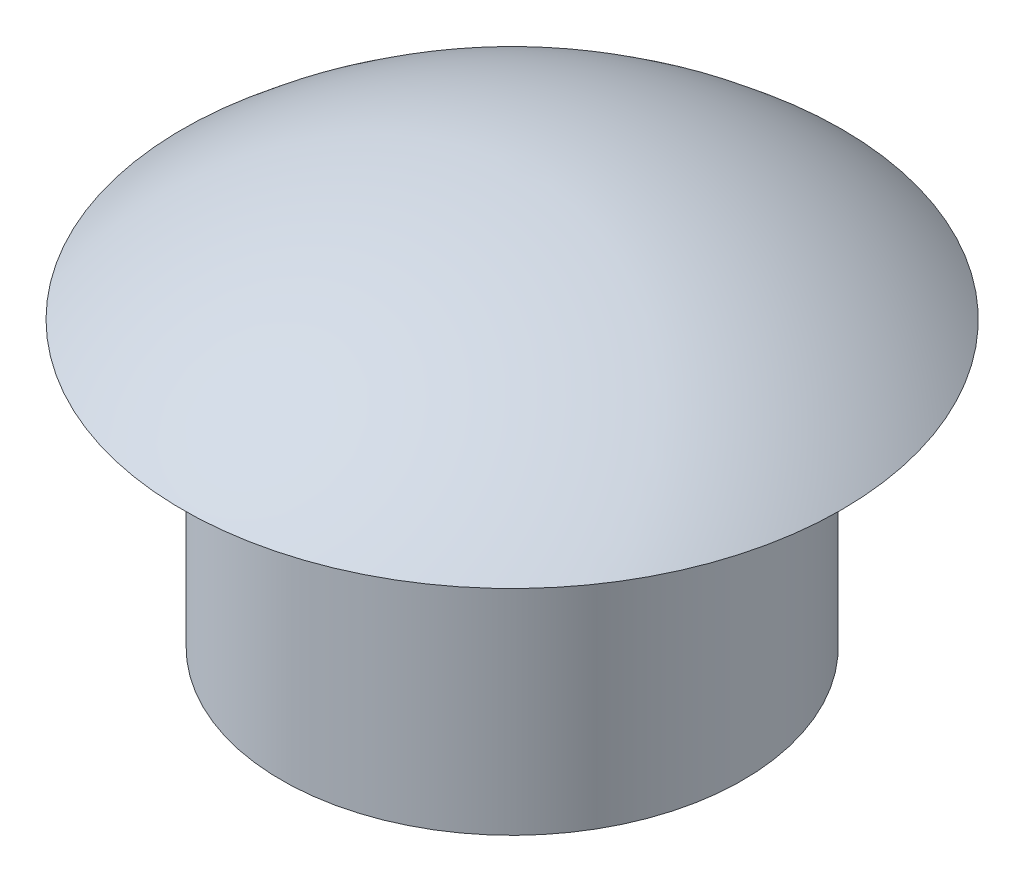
from build123d import *


with BuildPart() as part:
    # Esquisse1 → R_volution1 (revolve)
    with BuildSketch(Plane.XY, mode=Mode.PRIVATE) as r_volution1_sk:
        with BuildLine():
            Line((0, 3.999973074), (1.75, 3.999973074))
            Line((1.75, 3.999973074), (1.75, -1.4499e-05))
            Line((1.75, -1.4499e-05), (3.25, -2.6926e-05))
            Line((3.25, -2.6926e-05), (3.25, 3.999973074))
            Line((3.25, 3.999973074), (4.645712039, 3.999973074))
            ThreePointArc((4.645712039, 3.999973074), (2.481327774, 5.294393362), (0, 5.745054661))
            Line((0, 5.745054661), (0, 3.999973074))
        make_face()
    revolve(r_volution1_sk.sketch.rotate(Axis((0, 0, 0), (0, 1, 0)), 90), axis=Axis((0, 0, 0), (0, 1, 0)))


solid = part.part
